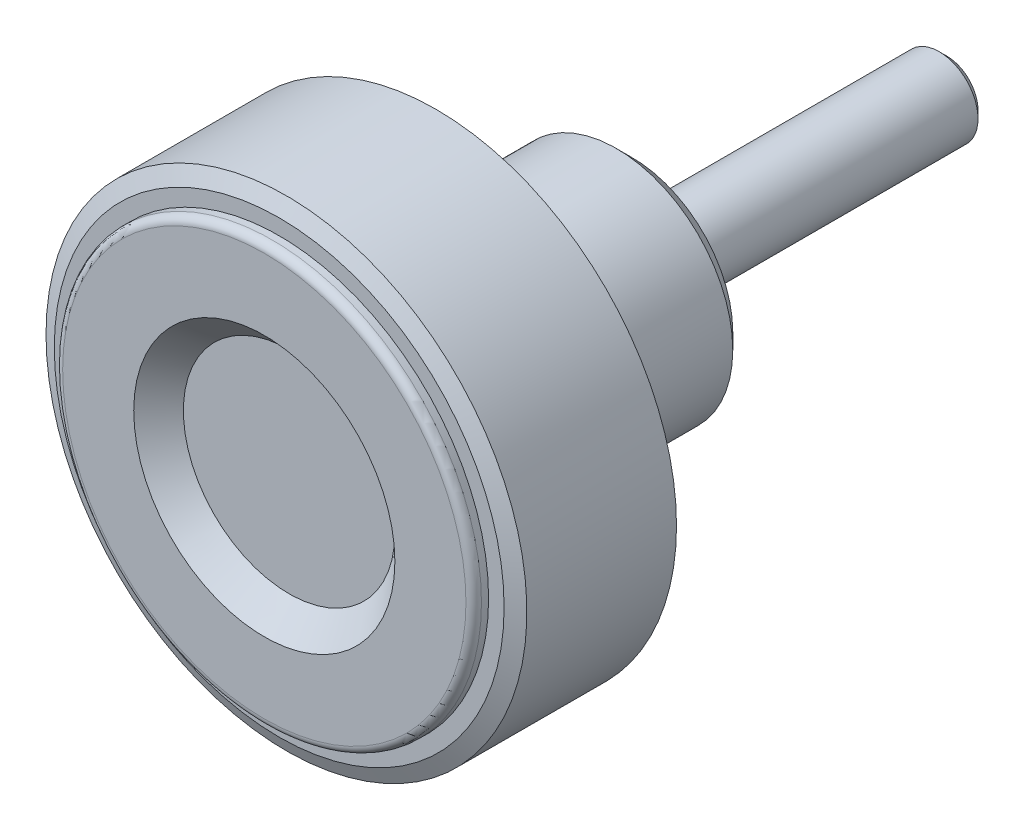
ISO-10303-21;
HEADER;
FILE_DESCRIPTION(('STEP AP214'),'2;1');
FILE_NAME('part.step','',(''),(''),'','','');
FILE_SCHEMA(('AUTOMOTIVE_DESIGN { 1 0 10303 214 1 1 1 1 }'));
ENDSEC;
DATA;
#1=APPLICATION_CONTEXT('core data for automotive mechanical design processes');
#2=APPLICATION_PROTOCOL_DEFINITION('international standard','automotive_design',2000,#1);
#3=PRODUCT_CONTEXT('',#1,'mechanical');
#4=PRODUCT('Part','Part','',(#3));
#5=PRODUCT_RELATED_PRODUCT_CATEGORY('part','',(#4));
#6=PRODUCT_DEFINITION_FORMATION('','',#4);
#7=PRODUCT_DEFINITION_CONTEXT('part definition',#1,'design');
#8=PRODUCT_DEFINITION('design','',#6,#7);
#9=PRODUCT_DEFINITION_SHAPE('','',#8);
#10=(LENGTH_UNIT() NAMED_UNIT(*) SI_UNIT(.MILLI.,.METRE.));
#11=(NAMED_UNIT(*) PLANE_ANGLE_UNIT() SI_UNIT($,.RADIAN.));
#12=(NAMED_UNIT(*) SI_UNIT($,.STERADIAN.) SOLID_ANGLE_UNIT());
#13=UNCERTAINTY_MEASURE_WITH_UNIT(LENGTH_MEASURE(1.E-05),#10,'distance_accuracy_value','');
#14=(GEOMETRIC_REPRESENTATION_CONTEXT(3) GLOBAL_UNCERTAINTY_ASSIGNED_CONTEXT((#13)) GLOBAL_UNIT_ASSIGNED_CONTEXT((#10,
#11,#12)) REPRESENTATION_CONTEXT('',''));
#15=CARTESIAN_POINT('',(0.,0.,0.));
#16=DIRECTION('',(0.,0.,1.));
#17=DIRECTION('',(1.,0.,0.));
#18=AXIS2_PLACEMENT_3D('',#15,#16,#17);
#19=CARTESIAN_POINT('',(0.,0.,0.));
#20=DIRECTION('',(0.,0.,-1.));
#21=DIRECTION('',(-1.,0.,0.));
#22=AXIS2_PLACEMENT_3D('',#19,#20,#21);
#23=CYLINDRICAL_SURFACE('',#22,15.5);
#24=CARTESIAN_POINT('',(0.,0.,22.573692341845));
#25=DIRECTION('',(0.,0.,-1.));
#26=DIRECTION('',(-1.,0.,0.));
#27=AXIS2_PLACEMENT_3D('',#24,#25,#26);
#28=CIRCLE('',#27,15.5);
#29=CARTESIAN_POINT('',(-15.5,0.,22.573692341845));
#30=VERTEX_POINT('',#29);
#31=EDGE_CURVE('E164',#30,#30,#28,.T.);
#32=ORIENTED_EDGE('',*,*,#31,.T.);
#33=EDGE_LOOP('',(#32));
#34=FACE_BOUND('',#33,.T.);
#35=CARTESIAN_POINT('',(0.,0.,12.926307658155));
#36=DIRECTION('',(0.,0.,1.));
#37=DIRECTION('',(0.,1.,0.));
#38=AXIS2_PLACEMENT_3D('',#35,#36,#37);
#39=CIRCLE('',#38,15.5);
#40=CARTESIAN_POINT('',(0.,15.5,12.926307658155));
#41=VERTEX_POINT('',#40);
#42=EDGE_CURVE('E160',#41,#41,#39,.F.);
#43=ORIENTED_EDGE('',*,*,#42,.F.);
#44=EDGE_LOOP('',(#43));
#45=FACE_BOUND('',#44,.T.);
#46=ADVANCED_FACE('F14',(#34,#45),#23,.T.);
#47=CARTESIAN_POINT('',(0.,0.,12.926307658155));
#48=DIRECTION('',(0.,0.,1.));
#49=DIRECTION('',(1.,0.,0.));
#50=AXIS2_PLACEMENT_3D('',#47,#48,#49);
#51=CONICAL_SURFACE('',#50,15.5,1.13446401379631);
#52=CARTESIAN_POINT('',(0.,0.,12.46));
#53=DIRECTION('',(0.,0.,1.));
#54=DIRECTION('',(1.,0.,0.));
#55=AXIS2_PLACEMENT_3D('',#52,#53,#54);
#56=CIRCLE('',#55,14.5);
#57=CARTESIAN_POINT('',(14.5,0.,12.46));
#58=VERTEX_POINT('',#57);
#59=EDGE_CURVE('E157',#58,#58,#56,.F.);
#60=ORIENTED_EDGE('',*,*,#59,.F.);
#61=EDGE_LOOP('',(#60));
#62=FACE_BOUND('',#61,.T.);
#63=ORIENTED_EDGE('',*,*,#42,.T.);
#64=EDGE_LOOP('',(#63));
#65=FACE_BOUND('',#64,.T.);
#66=ADVANCED_FACE('F457',(#62,#65),#51,.T.);
#67=CARTESIAN_POINT('',(0.,14.,12.46));
#68=DIRECTION('',(0.,0.,-1.));
#69=DIRECTION('',(-1.,0.,0.));
#70=AXIS2_PLACEMENT_3D('',#67,#68,#69);
#71=PLANE('',#70);
#72=ORIENTED_EDGE('',*,*,#59,.T.);
#73=EDGE_LOOP('',(#72));
#74=FACE_BOUND('',#73,.T.);
#75=CARTESIAN_POINT('',(0.,0.,12.46));
#76=DIRECTION('',(0.,0.,1.));
#77=DIRECTION('',(1.,0.,0.));
#78=AXIS2_PLACEMENT_3D('',#75,#76,#77);
#79=CIRCLE('',#78,13.5);
#80=CARTESIAN_POINT('',(13.5,0.,12.46));
#81=VERTEX_POINT('',#80);
#82=EDGE_CURVE('E154',#81,#81,#79,.F.);
#83=ORIENTED_EDGE('',*,*,#82,.F.);
#84=EDGE_LOOP('',(#83));
#85=FACE_BOUND('',#84,.T.);
#86=ADVANCED_FACE('F453',(#74,#85),#71,.T.);
#87=CARTESIAN_POINT('',(0.,1.00475,-20.));
#88=DIRECTION('',(0.,0.,-1.));
#89=DIRECTION('',(-1.,0.,0.));
#90=AXIS2_PLACEMENT_3D('',#87,#88,#89);
#91=PLANE('',#90);
#92=CARTESIAN_POINT('',(0.,0.,-20.0000000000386));
#93=DIRECTION('',(0.,0.,1.));
#94=DIRECTION('',(1.,0.,0.));
#95=AXIS2_PLACEMENT_3D('',#92,#93,#94);
#96=CIRCLE('',#95,2.00949999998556);
#97=CARTESIAN_POINT('',(2.00949999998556,0.,-20.0000000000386));
#98=VERTEX_POINT('',#97);
#99=EDGE_CURVE('E150',#98,#98,#96,.T.);
#100=ORIENTED_EDGE('',*,*,#99,.F.);
#101=EDGE_LOOP('',(#100));
#102=FACE_BOUND('',#101,.T.);
#103=ADVANCED_FACE('F449',(#102),#91,.T.);
#104=CARTESIAN_POINT('',(0.,0.,12.23));
#105=DIRECTION('',(0.,0.,1.));
#106=DIRECTION('',(1.,0.,0.));
#107=AXIS2_PLACEMENT_3D('',#104,#105,#106);
#108=CYLINDRICAL_SURFACE('',#107,13.5);
#109=ORIENTED_EDGE('',*,*,#82,.T.);
#110=EDGE_LOOP('',(#109));
#111=FACE_BOUND('',#110,.T.);
#112=CARTESIAN_POINT('',(0.,0.,12.));
#113=DIRECTION('',(0.,0.,-1.));
#114=DIRECTION('',(-1.,0.,0.));
#115=AXIS2_PLACEMENT_3D('',#112,#113,#114);
#116=CIRCLE('',#115,13.5);
#117=CARTESIAN_POINT('',(-13.5,0.,12.));
#118=VERTEX_POINT('',#117);
#119=EDGE_CURVE('E153',#118,#118,#116,.T.);
#120=ORIENTED_EDGE('',*,*,#119,.F.);
#121=EDGE_LOOP('',(#120));
#122=FACE_BOUND('',#121,.T.);
#123=ADVANCED_FACE('F416',(#111,#122),#108,.T.);
#124=CARTESIAN_POINT('',(0.,0.,-19.5095000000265));
#125=DIRECTION('',(0.,0.,1.));
#126=DIRECTION('',(1.,0.,0.));
#127=AXIS2_PLACEMENT_3D('',#124,#125,#126);
#128=CONICAL_SURFACE('',#127,2.50000000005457,0.785398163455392);
#129=ORIENTED_EDGE('',*,*,#99,.T.);
#130=EDGE_LOOP('',(#129));
#131=FACE_BOUND('',#130,.T.);
#132=CARTESIAN_POINT('',(0.,0.,-19.5095));
#133=DIRECTION('',(0.,0.,1.));
#134=DIRECTION('',(1.,0.,0.));
#135=AXIS2_PLACEMENT_3D('',#132,#133,#134);
#136=CIRCLE('',#135,2.5);
#137=CARTESIAN_POINT('',(2.5,0.,-19.5095));
#138=VERTEX_POINT('',#137);
#139=EDGE_CURVE('E343',#138,#138,#136,.T.);
#140=ORIENTED_EDGE('',*,*,#139,.F.);
#141=EDGE_LOOP('',(#140));
#142=FACE_BOUND('',#141,.T.);
#143=ADVANCED_FACE('F410',(#131,#142),#128,.T.);
#144=CARTESIAN_POINT('',(0.,0.,12.));
#145=DIRECTION('',(0.,0.,-1.));
#146=DIRECTION('',(-1.,0.,0.));
#147=AXIS2_PLACEMENT_3D('',#144,#145,#146);
#148=TOROIDAL_SURFACE('',#147,13.,0.5);
#149=ORIENTED_EDGE('',*,*,#119,.T.);
#150=EDGE_LOOP('',(#149));
#151=FACE_BOUND('',#150,.T.);
#152=CARTESIAN_POINT('',(0.,0.,11.5));
#153=DIRECTION('',(0.,0.,1.));
#154=DIRECTION('',(1.,0.,0.));
#155=AXIS2_PLACEMENT_3D('',#152,#153,#154);
#156=CIRCLE('',#155,13.);
#157=CARTESIAN_POINT('',(0.,13.,11.5));
#158=VERTEX_POINT('',#157);
#159=CARTESIAN_POINT('',(13.,0.,11.5));
#160=VERTEX_POINT('',#159);
#161=EDGE_CURVE('E306',#158,#160,#156,.F.);
#162=ORIENTED_EDGE('',*,*,#161,.F.);
#163=CARTESIAN_POINT('',(0.,0.,11.5));
#164=DIRECTION('',(0.,0.,1.));
#165=DIRECTION('',(0.,1.,0.));
#166=AXIS2_PLACEMENT_3D('',#163,#164,#165);
#167=CIRCLE('',#166,13.);
#168=CARTESIAN_POINT('',(-13.,0.,11.5));
#169=VERTEX_POINT('',#168);
#170=EDGE_CURVE('E149',#169,#158,#167,.F.);
#171=ORIENTED_EDGE('',*,*,#170,.F.);
#172=CARTESIAN_POINT('',(0.,0.,11.5));
#173=DIRECTION('',(0.,0.,1.));
#174=DIRECTION('',(-1.,0.,0.));
#175=AXIS2_PLACEMENT_3D('',#172,#173,#174);
#176=CIRCLE('',#175,13.);
#177=EDGE_CURVE('E340',#160,#169,#176,.F.);
#178=ORIENTED_EDGE('',*,*,#177,.F.);
#179=EDGE_LOOP('',(#162,#171,#178));
#180=FACE_BOUND('',#179,.T.);
#181=ADVANCED_FACE('F405',(#151,#180),#148,.T.);
#182=CARTESIAN_POINT('',(0.,0.,-9.25475));
#183=DIRECTION('',(0.,0.,1.));
#184=DIRECTION('',(1.,0.,0.));
#185=AXIS2_PLACEMENT_3D('',#182,#183,#184);
#186=CYLINDRICAL_SURFACE('',#185,2.5);
#187=ORIENTED_EDGE('',*,*,#139,.T.);
#188=EDGE_LOOP('',(#187));
#189=FACE_BOUND('',#188,.T.);
#190=CARTESIAN_POINT('',(0.,0.,0.));
#191=DIRECTION('',(0.,0.,1.));
#192=DIRECTION('',(1.,0.,0.));
#193=AXIS2_PLACEMENT_3D('',#190,#191,#192);
#194=CIRCLE('',#193,2.5);
#195=CARTESIAN_POINT('',(2.5,0.,0.));
#196=VERTEX_POINT('',#195);
#197=EDGE_CURVE('E146',#196,#196,#194,.T.);
#198=ORIENTED_EDGE('',*,*,#197,.F.);
#199=EDGE_LOOP('',(#198));
#200=FACE_BOUND('',#199,.T.);
#201=ADVANCED_FACE('F323',(#189,#200),#186,.T.);
#202=CARTESIAN_POINT('',(0.,12.4615384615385,11.5));
#203=DIRECTION('',(0.,0.,-1.));
#204=DIRECTION('',(-1.,0.,0.));
#205=AXIS2_PLACEMENT_3D('',#202,#203,#204);
#206=PLANE('',#205);
#207=ORIENTED_EDGE('',*,*,#177,.T.);
#208=ORIENTED_EDGE('',*,*,#170,.T.);
#209=ORIENTED_EDGE('',*,*,#161,.T.);
#210=EDGE_LOOP('',(#207,#208,#209));
#211=FACE_BOUND('',#210,.T.);
#212=CARTESIAN_POINT('',(0.,0.,11.5));
#213=DIRECTION('',(0.,0.,1.));
#214=DIRECTION('',(1.,0.,0.));
#215=AXIS2_PLACEMENT_3D('',#212,#213,#214);
#216=CIRCLE('',#215,11.9230769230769);
#217=CARTESIAN_POINT('',(11.9230769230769,0.,11.5));
#218=VERTEX_POINT('',#217);
#219=EDGE_CURVE('E143',#218,#218,#216,.T.);
#220=ORIENTED_EDGE('',*,*,#219,.T.);
#221=EDGE_LOOP('',(#220));
#222=FACE_BOUND('',#221,.T.);
#223=ADVANCED_FACE('F312',(#211,#222),#206,.T.);
#224=CARTESIAN_POINT('',(0.,1.66666666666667,0.));
#225=DIRECTION('',(0.,0.,-1.));
#226=DIRECTION('',(-1.,0.,0.));
#227=AXIS2_PLACEMENT_3D('',#224,#225,#226);
#228=PLANE('',#227);
#229=CARTESIAN_POINT('',(0.,0.,0.));
#230=DIRECTION('',(0.,0.,1.));
#231=DIRECTION('',(1.,0.,0.));
#232=AXIS2_PLACEMENT_3D('',#229,#230,#231);
#233=CIRCLE('',#232,3.33333333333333);
#234=CARTESIAN_POINT('',(3.33333333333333,0.,0.));
#235=VERTEX_POINT('',#234);
#236=EDGE_CURVE('E140',#235,#235,#233,.T.);
#237=ORIENTED_EDGE('',*,*,#236,.F.);
#238=EDGE_LOOP('',(#237));
#239=FACE_BOUND('',#238,.T.);
#240=ORIENTED_EDGE('',*,*,#197,.T.);
#241=EDGE_LOOP('',(#240));
#242=FACE_BOUND('',#241,.T.);
#243=ADVANCED_FACE('F322',(#239,#242),#228,.T.);
#244=CARTESIAN_POINT('',(0.,0.,15.25));
#245=DIRECTION('',(0.,0.,1.));
#246=DIRECTION('',(1.,0.,0.));
#247=AXIS2_PLACEMENT_3D('',#244,#245,#246);
#248=CYLINDRICAL_SURFACE('',#247,11.9230769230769);
#249=CARTESIAN_POINT('',(0.,0.,19.));
#250=DIRECTION('',(0.,0.,-1.));
#251=DIRECTION('',(-1.,0.,0.));
#252=AXIS2_PLACEMENT_3D('',#249,#250,#251);
#253=CIRCLE('',#252,11.9230769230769);
#254=CARTESIAN_POINT('',(-11.9230769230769,0.,19.));
#255=VERTEX_POINT('',#254);
#256=EDGE_CURVE('E139',#255,#255,#253,.F.);
#257=ORIENTED_EDGE('',*,*,#256,.T.);
#258=EDGE_LOOP('',(#257));
#259=FACE_BOUND('',#258,.T.);
#260=ORIENTED_EDGE('',*,*,#219,.F.);
#261=EDGE_LOOP('',(#260));
#262=FACE_BOUND('',#261,.T.);
#263=ADVANCED_FACE('F391',(#259,#262),#248,.F.);
#264=CARTESIAN_POINT('',(0.,0.,0.15));
#265=DIRECTION('',(0.,0.,1.));
#266=DIRECTION('',(1.,0.,0.));
#267=AXIS2_PLACEMENT_3D('',#264,#265,#266);
#268=CYLINDRICAL_SURFACE('',#267,3.33333333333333);
#269=ORIENTED_EDGE('',*,*,#236,.T.);
#270=EDGE_LOOP('',(#269));
#271=FACE_BOUND('',#270,.T.);
#272=CARTESIAN_POINT('',(0.,0.,0.3));
#273=DIRECTION('',(0.,0.,1.));
#274=DIRECTION('',(1.,0.,0.));
#275=AXIS2_PLACEMENT_3D('',#272,#273,#274);
#276=CIRCLE('',#275,3.33333333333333);
#277=CARTESIAN_POINT('',(3.33333333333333,0.,0.3));
#278=VERTEX_POINT('',#277);
#279=EDGE_CURVE('E135',#278,#278,#276,.T.);
#280=ORIENTED_EDGE('',*,*,#279,.F.);
#281=EDGE_LOOP('',(#280));
#282=FACE_BOUND('',#281,.T.);
#283=ADVANCED_FACE('F282',(#271,#282),#268,.T.);
#284=CARTESIAN_POINT('',(0.,0.,19.));
#285=DIRECTION('',(0.,0.,-1.));
#286=DIRECTION('',(-1.,0.,0.));
#287=AXIS2_PLACEMENT_3D('',#284,#285,#286);
#288=TOROIDAL_SURFACE('',#287,10.9230769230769,1.);
#289=CARTESIAN_POINT('',(0.,0.,20.));
#290=DIRECTION('',(0.,0.,1.));
#291=DIRECTION('',(0.,1.,0.));
#292=AXIS2_PLACEMENT_3D('',#289,#290,#291);
#293=CIRCLE('',#292,10.9230769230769);
#294=CARTESIAN_POINT('',(-10.9230769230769,0.,20.));
#295=VERTEX_POINT('',#294);
#296=CARTESIAN_POINT('',(0.,10.9230769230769,20.));
#297=VERTEX_POINT('',#296);
#298=EDGE_CURVE('E134',#295,#297,#293,.F.);
#299=ORIENTED_EDGE('',*,*,#298,.F.);
#300=CARTESIAN_POINT('',(0.,0.,20.));
#301=DIRECTION('',(0.,0.,1.));
#302=DIRECTION('',(-1.,0.,0.));
#303=AXIS2_PLACEMENT_3D('',#300,#301,#302);
#304=CIRCLE('',#303,10.9230769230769);
#305=CARTESIAN_POINT('',(10.9230769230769,0.,20.));
#306=VERTEX_POINT('',#305);
#307=EDGE_CURVE('E656',#306,#295,#304,.F.);
#308=ORIENTED_EDGE('',*,*,#307,.F.);
#309=CARTESIAN_POINT('',(0.,0.,20.));
#310=DIRECTION('',(0.,0.,1.));
#311=DIRECTION('',(1.,0.,0.));
#312=AXIS2_PLACEMENT_3D('',#309,#310,#311);
#313=CIRCLE('',#312,10.9230769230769);
#314=EDGE_CURVE('E138',#297,#306,#313,.F.);
#315=ORIENTED_EDGE('',*,*,#314,.F.);
#316=EDGE_LOOP('',(#299,#308,#315));
#317=FACE_BOUND('',#316,.T.);
#318=ORIENTED_EDGE('',*,*,#256,.F.);
#319=EDGE_LOOP('',(#318));
#320=FACE_BOUND('',#319,.T.);
#321=ADVANCED_FACE('F278',(#317,#320),#288,.F.);
#322=CARTESIAN_POINT('',(0.,4.91666666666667,0.3));
#323=DIRECTION('',(0.,0.,-1.));
#324=DIRECTION('',(-1.,0.,0.));
#325=AXIS2_PLACEMENT_3D('',#322,#323,#324);
#326=PLANE('',#325);
#327=CARTESIAN_POINT('',(0.,0.,0.3));
#328=DIRECTION('',(0.,0.,1.));
#329=DIRECTION('',(1.,0.,0.));
#330=AXIS2_PLACEMENT_3D('',#327,#328,#329);
#331=CIRCLE('',#330,6.5);
#332=CARTESIAN_POINT('',(6.5,0.,0.3));
#333=VERTEX_POINT('',#332);
#334=EDGE_CURVE('E125',#333,#333,#331,.T.);
#335=ORIENTED_EDGE('',*,*,#334,.F.);
#336=EDGE_LOOP('',(#335));
#337=FACE_BOUND('',#336,.T.);
#338=ORIENTED_EDGE('',*,*,#279,.T.);
#339=EDGE_LOOP('',(#338));
#340=FACE_BOUND('',#339,.T.);
#341=ADVANCED_FACE('F216',(#337,#340),#326,.T.);
#342=CARTESIAN_POINT('',(0.,9.71153846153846,20.));
#343=DIRECTION('',(0.,0.,-1.));
#344=DIRECTION('',(-1.,0.,0.));
#345=AXIS2_PLACEMENT_3D('',#342,#343,#344);
#346=PLANE('',#345);
#347=ORIENTED_EDGE('',*,*,#307,.T.);
#348=ORIENTED_EDGE('',*,*,#298,.T.);
#349=ORIENTED_EDGE('',*,*,#314,.T.);
#350=EDGE_LOOP('',(#347,#348,#349));
#351=FACE_BOUND('',#350,.T.);
#352=CARTESIAN_POINT('',(0.,0.,20.));
#353=DIRECTION('',(0.,0.,-1.));
#354=DIRECTION('',(-1.,0.,0.));
#355=AXIS2_PLACEMENT_3D('',#352,#353,#354);
#356=CIRCLE('',#355,8.5);
#357=CARTESIAN_POINT('',(0.,8.5,20.));
#358=VERTEX_POINT('',#357);
#359=CARTESIAN_POINT('',(-8.5,0.,20.));
#360=VERTEX_POINT('',#359);
#361=EDGE_CURVE('E33',#358,#360,#356,.F.);
#362=ORIENTED_EDGE('',*,*,#361,.T.);
#363=CARTESIAN_POINT('',(0.,0.,20.));
#364=DIRECTION('',(0.,0.,-1.));
#365=DIRECTION('',(1.,0.,0.));
#366=AXIS2_PLACEMENT_3D('',#363,#364,#365);
#367=CIRCLE('',#366,8.5);
#368=CARTESIAN_POINT('',(8.5,0.,20.));
#369=VERTEX_POINT('',#368);
#370=EDGE_CURVE('E133',#360,#369,#367,.F.);
#371=ORIENTED_EDGE('',*,*,#370,.T.);
#372=CARTESIAN_POINT('',(0.,0.,20.));
#373=DIRECTION('',(0.,0.,-1.));
#374=DIRECTION('',(0.,1.,0.));
#375=AXIS2_PLACEMENT_3D('',#372,#373,#374);
#376=CIRCLE('',#375,8.5);
#377=EDGE_CURVE('E203',#369,#358,#376,.F.);
#378=ORIENTED_EDGE('',*,*,#377,.T.);
#379=EDGE_LOOP('',(#362,#371,#378));
#380=FACE_BOUND('',#379,.T.);
#381=ADVANCED_FACE('F207',(#351,#380),#346,.T.);
#382=CARTESIAN_POINT('',(0.,0.,1.3));
#383=DIRECTION('',(0.,0.,1.));
#384=DIRECTION('',(1.,0.,0.));
#385=AXIS2_PLACEMENT_3D('',#382,#383,#384);
#386=CONICAL_SURFACE('',#385,7.5,0.785398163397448);
#387=ORIENTED_EDGE('',*,*,#334,.T.);
#388=EDGE_LOOP('',(#387));
#389=FACE_BOUND('',#388,.T.);
#390=CARTESIAN_POINT('',(0.,0.,1.3));
#391=DIRECTION('',(0.,0.,1.));
#392=DIRECTION('',(1.,0.,0.));
#393=AXIS2_PLACEMENT_3D('',#390,#391,#392);
#394=CIRCLE('',#393,7.5);
#395=CARTESIAN_POINT('',(7.5,0.,1.3));
#396=VERTEX_POINT('',#395);
#397=EDGE_CURVE('E24',#396,#396,#394,.T.);
#398=ORIENTED_EDGE('',*,*,#397,.F.);
#399=EDGE_LOOP('',(#398));
#400=FACE_BOUND('',#399,.T.);
#401=ADVANCED_FACE('F194',(#389,#400),#386,.T.);
#402=CARTESIAN_POINT('',(0.,0.,19.));
#403=DIRECTION('',(0.,0.,-1.));
#404=DIRECTION('',(-1.,0.,0.));
#405=AXIS2_PLACEMENT_3D('',#402,#403,#404);
#406=TOROIDAL_SURFACE('',#405,8.5,1.);
#407=CARTESIAN_POINT('',(0.,0.,19.));
#408=DIRECTION('',(0.,0.,1.));
#409=DIRECTION('',(1.,0.,0.));
#410=AXIS2_PLACEMENT_3D('',#407,#408,#409);
#411=CIRCLE('',#410,7.5);
#412=CARTESIAN_POINT('',(7.5,0.,19.));
#413=VERTEX_POINT('',#412);
#414=EDGE_CURVE('E9',#413,#413,#411,.F.);
#415=ORIENTED_EDGE('',*,*,#414,.F.);
#416=EDGE_LOOP('',(#415));
#417=FACE_BOUND('',#416,.T.);
#418=ORIENTED_EDGE('',*,*,#370,.F.);
#419=ORIENTED_EDGE('',*,*,#361,.F.);
#420=ORIENTED_EDGE('',*,*,#377,.F.);
#421=EDGE_LOOP('',(#418,#419,#420));
#422=FACE_BOUND('',#421,.T.);
#423=ADVANCED_FACE('F182',(#417,#422),#406,.F.);
#424=CARTESIAN_POINT('',(0.,0.,10.15));
#425=DIRECTION('',(0.,0.,1.));
#426=DIRECTION('',(1.,0.,0.));
#427=AXIS2_PLACEMENT_3D('',#424,#425,#426);
#428=CYLINDRICAL_SURFACE('',#427,7.5);
#429=ORIENTED_EDGE('',*,*,#397,.T.);
#430=EDGE_LOOP('',(#429));
#431=FACE_BOUND('',#430,.T.);
#432=ORIENTED_EDGE('',*,*,#414,.T.);
#433=EDGE_LOOP('',(#432));
#434=FACE_BOUND('',#433,.T.);
#435=ADVANCED_FACE('F193',(#431,#434),#428,.T.);
#436=CARTESIAN_POINT('',(0.,3.40909090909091,22.4));
#437=DIRECTION('',(0.,0.,1.));
#438=DIRECTION('',(1.,0.,0.));
#439=AXIS2_PLACEMENT_3D('',#436,#437,#438);
#440=PLANE('',#439);
#441=CARTESIAN_POINT('',(0.,0.,22.4));
#442=DIRECTION('',(0.,0.,1.));
#443=DIRECTION('',(1.,0.,0.));
#444=AXIS2_PLACEMENT_3D('',#441,#442,#443);
#445=CIRCLE('',#444,6.81818181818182);
#446=CARTESIAN_POINT('',(6.81818181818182,0.,22.4));
#447=VERTEX_POINT('',#446);
#448=EDGE_CURVE('E171',#447,#447,#445,.T.);
#449=ORIENTED_EDGE('',*,*,#448,.T.);
#450=EDGE_LOOP('',(#449));
#451=FACE_BOUND('',#450,.T.);
#452=ADVANCED_FACE('F16',(#451),#440,.T.);
#453=CARTESIAN_POINT('',(0.,0.,24.));
#454=DIRECTION('',(0.,0.,1.));
#455=DIRECTION('',(1.,0.,0.));
#456=AXIS2_PLACEMENT_3D('',#453,#454,#455);
#457=CONICAL_SURFACE('',#456,8.41818181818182,0.785398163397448);
#458=CARTESIAN_POINT('',(0.,0.,24.));
#459=DIRECTION('',(0.,0.,1.));
#460=DIRECTION('',(1.,0.,0.));
#461=AXIS2_PLACEMENT_3D('',#458,#459,#460);
#462=CIRCLE('',#461,8.41818181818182);
#463=CARTESIAN_POINT('',(8.41818181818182,0.,24.));
#464=VERTEX_POINT('',#463);
#465=EDGE_CURVE('E77',#464,#464,#462,.F.);
#466=ORIENTED_EDGE('',*,*,#465,.F.);
#467=EDGE_LOOP('',(#466));
#468=FACE_BOUND('',#467,.T.);
#469=ORIENTED_EDGE('',*,*,#448,.F.);
#470=EDGE_LOOP('',(#469));
#471=FACE_BOUND('',#470,.T.);
#472=ADVANCED_FACE('F99',(#468,#471),#457,.F.);
#473=CARTESIAN_POINT('',(0.,10.7090909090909,24.));
#474=DIRECTION('',(0.,0.,1.));
#475=DIRECTION('',(1.,0.,0.));
#476=AXIS2_PLACEMENT_3D('',#473,#474,#475);
#477=PLANE('',#476);
#478=ORIENTED_EDGE('',*,*,#465,.T.);
#479=EDGE_LOOP('',(#478));
#480=FACE_BOUND('',#479,.T.);
#481=CARTESIAN_POINT('',(0.,0.,24.));
#482=DIRECTION('',(0.,0.,-1.));
#483=DIRECTION('',(-1.,0.,0.));
#484=AXIS2_PLACEMENT_3D('',#481,#482,#483);
#485=CIRCLE('',#484,13.);
#486=CARTESIAN_POINT('',(-13.,0.,24.));
#487=VERTEX_POINT('',#486);
#488=CARTESIAN_POINT('',(0.,13.,24.));
#489=VERTEX_POINT('',#488);
#490=EDGE_CURVE('E71',#487,#489,#485,.T.);
#491=ORIENTED_EDGE('',*,*,#490,.F.);
#492=CARTESIAN_POINT('',(0.,0.,24.));
#493=DIRECTION('',(0.,0.,-1.));
#494=DIRECTION('',(1.,0.,0.));
#495=AXIS2_PLACEMENT_3D('',#492,#493,#494);
#496=CIRCLE('',#495,13.);
#497=CARTESIAN_POINT('',(13.,0.,24.));
#498=VERTEX_POINT('',#497);
#499=EDGE_CURVE('E66',#498,#487,#496,.T.);
#500=ORIENTED_EDGE('',*,*,#499,.F.);
#501=CARTESIAN_POINT('',(0.,0.,24.));
#502=DIRECTION('',(0.,0.,-1.));
#503=DIRECTION('',(0.,1.,0.));
#504=AXIS2_PLACEMENT_3D('',#501,#502,#503);
#505=CIRCLE('',#504,13.);
#506=EDGE_CURVE('E73',#489,#498,#505,.T.);
#507=ORIENTED_EDGE('',*,*,#506,.F.);
#508=EDGE_LOOP('',(#491,#500,#507));
#509=FACE_BOUND('',#508,.T.);
#510=ADVANCED_FACE('F81',(#480,#509),#477,.T.);
#511=CARTESIAN_POINT('',(0.,0.,23.5));
#512=DIRECTION('',(0.,0.,-1.));
#513=DIRECTION('',(-1.,0.,0.));
#514=AXIS2_PLACEMENT_3D('',#511,#512,#513);
#515=TOROIDAL_SURFACE('',#514,13.,0.5);
#516=ORIENTED_EDGE('',*,*,#499,.T.);
#517=ORIENTED_EDGE('',*,*,#490,.T.);
#518=ORIENTED_EDGE('',*,*,#506,.T.);
#519=EDGE_LOOP('',(#516,#517,#518));
#520=FACE_BOUND('',#519,.T.);
#521=CARTESIAN_POINT('',(0.,0.,23.5));
#522=DIRECTION('',(0.,0.,1.));
#523=DIRECTION('',(1.,0.,0.));
#524=AXIS2_PLACEMENT_3D('',#521,#522,#523);
#525=CIRCLE('',#524,13.5);
#526=CARTESIAN_POINT('',(13.5,0.,23.5));
#527=VERTEX_POINT('',#526);
#528=EDGE_CURVE('E168',#527,#527,#525,.F.);
#529=ORIENTED_EDGE('',*,*,#528,.F.);
#530=EDGE_LOOP('',(#529));
#531=FACE_BOUND('',#530,.T.);
#532=ADVANCED_FACE('F69',(#520,#531),#515,.T.);
#533=CARTESIAN_POINT('',(0.,0.,23.27));
#534=DIRECTION('',(0.,0.,1.));
#535=DIRECTION('',(1.,0.,0.));
#536=AXIS2_PLACEMENT_3D('',#533,#534,#535);
#537=CYLINDRICAL_SURFACE('',#536,13.5);
#538=CARTESIAN_POINT('',(0.,0.,23.04));
#539=DIRECTION('',(0.,0.,1.));
#540=DIRECTION('',(1.,0.,0.));
#541=AXIS2_PLACEMENT_3D('',#538,#539,#540);
#542=CIRCLE('',#541,13.5);
#543=CARTESIAN_POINT('',(13.5,0.,23.04));
#544=VERTEX_POINT('',#543);
#545=EDGE_CURVE('E165',#544,#544,#542,.F.);
#546=ORIENTED_EDGE('',*,*,#545,.F.);
#547=EDGE_LOOP('',(#546));
#548=FACE_BOUND('',#547,.T.);
#549=ORIENTED_EDGE('',*,*,#528,.T.);
#550=EDGE_LOOP('',(#549));
#551=FACE_BOUND('',#550,.T.);
#552=ADVANCED_FACE('F359',(#548,#551),#537,.T.);
#553=CARTESIAN_POINT('',(0.,0.,22.573692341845));
#554=DIRECTION('',(0.,0.,-1.));
#555=DIRECTION('',(-1.,0.,0.));
#556=AXIS2_PLACEMENT_3D('',#553,#554,#555);
#557=CONICAL_SURFACE('',#556,15.5,1.13446401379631);
#558=ORIENTED_EDGE('',*,*,#31,.F.);
#559=EDGE_LOOP('',(#558));
#560=FACE_BOUND('',#559,.T.);
#561=CARTESIAN_POINT('',(0.,0.,23.04));
#562=DIRECTION('',(0.,0.,-1.));
#563=DIRECTION('',(-1.,0.,0.));
#564=AXIS2_PLACEMENT_3D('',#561,#562,#563);
#565=CIRCLE('',#564,14.5);
#566=CARTESIAN_POINT('',(-14.5,0.,23.04));
#567=VERTEX_POINT('',#566);
#568=EDGE_CURVE('E161',#567,#567,#565,.T.);
#569=ORIENTED_EDGE('',*,*,#568,.T.);
#570=EDGE_LOOP('',(#569));
#571=FACE_BOUND('',#570,.T.);
#572=ADVANCED_FACE('F366',(#560,#571),#557,.T.);
#573=CARTESIAN_POINT('',(0.,14.,23.04));
#574=DIRECTION('',(0.,0.,1.));
#575=DIRECTION('',(1.,0.,0.));
#576=AXIS2_PLACEMENT_3D('',#573,#574,#575);
#577=PLANE('',#576);
#578=ORIENTED_EDGE('',*,*,#545,.T.);
#579=EDGE_LOOP('',(#578));
#580=FACE_BOUND('',#579,.T.);
#581=ORIENTED_EDGE('',*,*,#568,.F.);
#582=EDGE_LOOP('',(#581));
#583=FACE_BOUND('',#582,.T.);
#584=ADVANCED_FACE('F467',(#580,#583),#577,.T.);
#585=CLOSED_SHELL('',(#46,#66,#86,#103,#123,#143,#181,#201,#223,#243,#263,#283,#321,#341,#381,
#401,#423,#435,#452,#472,#510,#532,#552,#572,#584));
#586=MANIFOLD_SOLID_BREP('B1',#585);
#587=ADVANCED_BREP_SHAPE_REPRESENTATION('',(#18,#586),#14);
#588=SHAPE_DEFINITION_REPRESENTATION(#9,#587);
ENDSEC;
END-ISO-10303-21;
